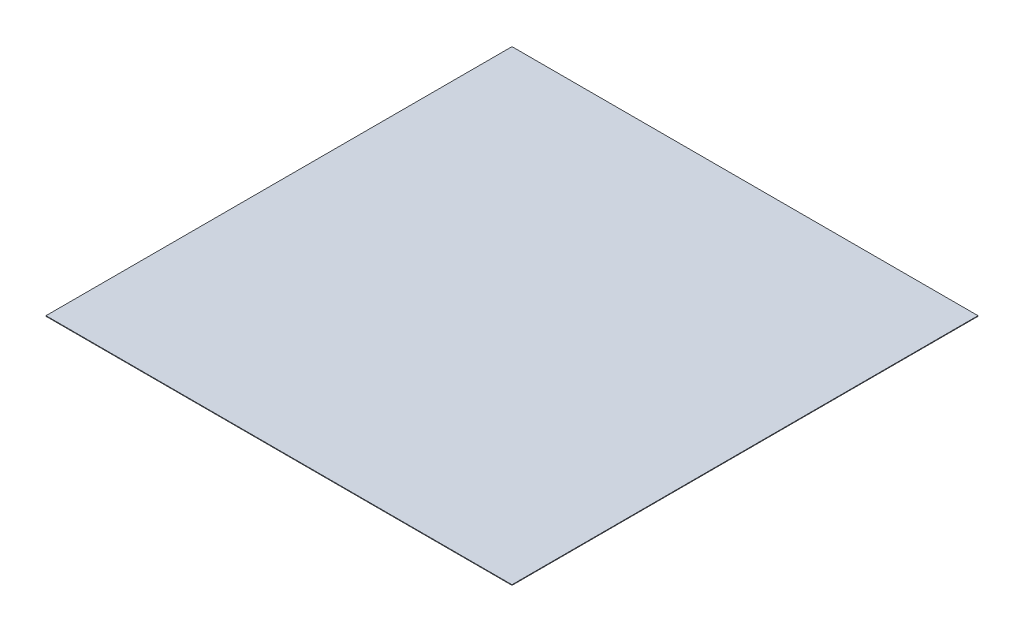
ISO-10303-21;
HEADER;
FILE_DESCRIPTION(('STEP AP214'),'2;1');
FILE_NAME('part.step','',(''),(''),'','','');
FILE_SCHEMA(('AUTOMOTIVE_DESIGN { 1 0 10303 214 1 1 1 1 }'));
ENDSEC;
DATA;
#1=APPLICATION_CONTEXT('core data for automotive mechanical design processes');
#2=APPLICATION_PROTOCOL_DEFINITION('international standard','automotive_design',2000,#1);
#3=PRODUCT_CONTEXT('',#1,'mechanical');
#4=PRODUCT('Part','Part','',(#3));
#5=PRODUCT_RELATED_PRODUCT_CATEGORY('part','',(#4));
#6=PRODUCT_DEFINITION_FORMATION('','',#4);
#7=PRODUCT_DEFINITION_CONTEXT('part definition',#1,'design');
#8=PRODUCT_DEFINITION('design','',#6,#7);
#9=PRODUCT_DEFINITION_SHAPE('','',#8);
#10=(LENGTH_UNIT() NAMED_UNIT(*) SI_UNIT(.MILLI.,.METRE.));
#11=(NAMED_UNIT(*) PLANE_ANGLE_UNIT() SI_UNIT($,.RADIAN.));
#12=(NAMED_UNIT(*) SI_UNIT($,.STERADIAN.) SOLID_ANGLE_UNIT());
#13=UNCERTAINTY_MEASURE_WITH_UNIT(LENGTH_MEASURE(1.E-05),#10,'distance_accuracy_value','');
#14=(GEOMETRIC_REPRESENTATION_CONTEXT(3) GLOBAL_UNCERTAINTY_ASSIGNED_CONTEXT((#13)) GLOBAL_UNIT_ASSIGNED_CONTEXT((#10,
#11,#12)) REPRESENTATION_CONTEXT('',''));
#15=CARTESIAN_POINT('',(0.,0.,0.));
#16=DIRECTION('',(0.,0.,1.));
#17=DIRECTION('',(1.,0.,0.));
#18=AXIS2_PLACEMENT_3D('',#15,#16,#17);
#19=CARTESIAN_POINT('',(10160.,12.7,-10160.));
#20=DIRECTION('',(0.,0.,1.));
#21=DIRECTION('',(1.,0.,0.));
#22=AXIS2_PLACEMENT_3D('',#19,#20,#21);
#23=PLANE('',#22);
#24=DIRECTION('',(0.,1.,0.));
#25=VECTOR('',#24,1.);
#26=CARTESIAN_POINT('',(-10160.,12.7,-10160.));
#27=LINE('',#26,#25);
#28=CARTESIAN_POINT('',(-10160.,-12.7,-10160.));
#29=VERTEX_POINT('',#28);
#30=CARTESIAN_POINT('',(-10160.,12.7,-10160.));
#31=VERTEX_POINT('',#30);
#32=EDGE_CURVE('E96',#29,#31,#27,.T.);
#33=ORIENTED_EDGE('',*,*,#32,.T.);
#34=DIRECTION('',(-1.,0.,0.));
#35=VECTOR('',#34,1.);
#36=CARTESIAN_POINT('',(10160.,12.7,-10160.));
#37=LINE('',#36,#35);
#38=CARTESIAN_POINT('',(10160.,12.7,-10160.));
#39=VERTEX_POINT('',#38);
#40=EDGE_CURVE('E11',#39,#31,#37,.T.);
#41=ORIENTED_EDGE('',*,*,#40,.F.);
#42=DIRECTION('',(0.,1.,0.));
#43=VECTOR('',#42,1.);
#44=CARTESIAN_POINT('',(10160.,12.7,-10160.));
#45=LINE('',#44,#43);
#46=CARTESIAN_POINT('',(10160.,-12.7,-10160.));
#47=VERTEX_POINT('',#46);
#48=EDGE_CURVE('E84',#47,#39,#45,.T.);
#49=ORIENTED_EDGE('',*,*,#48,.F.);
#50=DIRECTION('',(-1.,0.,0.));
#51=VECTOR('',#50,1.);
#52=CARTESIAN_POINT('',(10160.,-12.7,-10160.));
#53=LINE('',#52,#51);
#54=EDGE_CURVE('E92',#47,#29,#53,.T.);
#55=ORIENTED_EDGE('',*,*,#54,.T.);
#56=EDGE_LOOP('',(#33,#41,#49,#55));
#57=FACE_BOUND('',#56,.T.);
#58=ADVANCED_FACE('F33',(#57),#23,.F.);
#59=CARTESIAN_POINT('',(10160.,12.7,10160.));
#60=DIRECTION('',(0.,-1.,0.));
#61=DIRECTION('',(0.,0.,-1.));
#62=AXIS2_PLACEMENT_3D('',#59,#60,#61);
#63=PLANE('',#62);
#64=DIRECTION('',(0.,0.,1.));
#65=VECTOR('',#64,1.);
#66=CARTESIAN_POINT('',(-10160.,12.7,10160.));
#67=LINE('',#66,#65);
#68=CARTESIAN_POINT('',(-10160.,12.7,10160.));
#69=VERTEX_POINT('',#68);
#70=EDGE_CURVE('E88',#31,#69,#67,.T.);
#71=ORIENTED_EDGE('',*,*,#70,.T.);
#72=DIRECTION('',(-1.,0.,0.));
#73=VECTOR('',#72,1.);
#74=CARTESIAN_POINT('',(10160.,12.7,10160.));
#75=LINE('',#74,#73);
#76=CARTESIAN_POINT('',(10160.,12.7,10160.));
#77=VERTEX_POINT('',#76);
#78=EDGE_CURVE('E41',#77,#69,#75,.T.);
#79=ORIENTED_EDGE('',*,*,#78,.F.);
#80=DIRECTION('',(0.,0.,1.));
#81=VECTOR('',#80,1.);
#82=CARTESIAN_POINT('',(10160.,12.7,10160.));
#83=LINE('',#82,#81);
#84=EDGE_CURVE('E79',#39,#77,#83,.T.);
#85=ORIENTED_EDGE('',*,*,#84,.F.);
#86=ORIENTED_EDGE('',*,*,#40,.T.);
#87=EDGE_LOOP('',(#71,#79,#85,#86));
#88=FACE_BOUND('',#87,.T.);
#89=ADVANCED_FACE('F87',(#88),#63,.F.);
#90=CARTESIAN_POINT('',(10160.,12.7,10160.));
#91=DIRECTION('',(0.,0.,-1.));
#92=DIRECTION('',(-1.,0.,0.));
#93=AXIS2_PLACEMENT_3D('',#90,#91,#92);
#94=PLANE('',#93);
#95=DIRECTION('',(0.,-1.,0.));
#96=VECTOR('',#95,1.);
#97=CARTESIAN_POINT('',(-10160.,12.7,10160.));
#98=LINE('',#97,#96);
#99=CARTESIAN_POINT('',(-10160.,-12.7,10160.));
#100=VERTEX_POINT('',#99);
#101=EDGE_CURVE('E66',#69,#100,#98,.T.);
#102=ORIENTED_EDGE('',*,*,#101,.T.);
#103=DIRECTION('',(-1.,0.,0.));
#104=VECTOR('',#103,1.);
#105=CARTESIAN_POINT('',(10160.,-12.7,10160.));
#106=LINE('',#105,#104);
#107=CARTESIAN_POINT('',(10160.,-12.7,10160.));
#108=VERTEX_POINT('',#107);
#109=EDGE_CURVE('E89',#108,#100,#106,.T.);
#110=ORIENTED_EDGE('',*,*,#109,.F.);
#111=DIRECTION('',(0.,-1.,0.));
#112=VECTOR('',#111,1.);
#113=CARTESIAN_POINT('',(10160.,12.7,10160.));
#114=LINE('',#113,#112);
#115=EDGE_CURVE('E82',#77,#108,#114,.T.);
#116=ORIENTED_EDGE('',*,*,#115,.F.);
#117=ORIENTED_EDGE('',*,*,#78,.T.);
#118=EDGE_LOOP('',(#102,#110,#116,#117));
#119=FACE_BOUND('',#118,.T.);
#120=ADVANCED_FACE('F90',(#119),#94,.F.);
#121=CARTESIAN_POINT('',(10160.,-12.7,10160.));
#122=DIRECTION('',(0.,1.,0.));
#123=DIRECTION('',(0.,0.,1.));
#124=AXIS2_PLACEMENT_3D('',#121,#122,#123);
#125=PLANE('',#124);
#126=DIRECTION('',(0.,0.,-1.));
#127=VECTOR('',#126,1.);
#128=CARTESIAN_POINT('',(-10160.,-12.7,10160.));
#129=LINE('',#128,#127);
#130=EDGE_CURVE('E72',#100,#29,#129,.T.);
#131=ORIENTED_EDGE('',*,*,#130,.T.);
#132=ORIENTED_EDGE('',*,*,#54,.F.);
#133=DIRECTION('',(0.,0.,-1.));
#134=VECTOR('',#133,1.);
#135=CARTESIAN_POINT('',(10160.,-12.7,10160.));
#136=LINE('',#135,#134);
#137=EDGE_CURVE('E49',#108,#47,#136,.T.);
#138=ORIENTED_EDGE('',*,*,#137,.F.);
#139=ORIENTED_EDGE('',*,*,#109,.T.);
#140=EDGE_LOOP('',(#131,#132,#138,#139));
#141=FACE_BOUND('',#140,.T.);
#142=ADVANCED_FACE('F103',(#141),#125,.F.);
#143=CARTESIAN_POINT('',(10160.,0.,0.));
#144=DIRECTION('',(1.,0.,0.));
#145=DIRECTION('',(0.,0.,-1.));
#146=AXIS2_PLACEMENT_3D('',#143,#144,#145);
#147=PLANE('',#146);
#148=ORIENTED_EDGE('',*,*,#48,.T.);
#149=ORIENTED_EDGE('',*,*,#84,.T.);
#150=ORIENTED_EDGE('',*,*,#115,.T.);
#151=ORIENTED_EDGE('',*,*,#137,.T.);
#152=EDGE_LOOP('',(#148,#149,#150,#151));
#153=FACE_BOUND('',#152,.T.);
#154=ADVANCED_FACE('F80',(#153),#147,.T.);
#155=CARTESIAN_POINT('',(-10160.,0.,0.));
#156=DIRECTION('',(1.,0.,0.));
#157=DIRECTION('',(0.,0.,-1.));
#158=AXIS2_PLACEMENT_3D('',#155,#156,#157);
#159=PLANE('',#158);
#160=ORIENTED_EDGE('',*,*,#32,.F.);
#161=ORIENTED_EDGE('',*,*,#130,.F.);
#162=ORIENTED_EDGE('',*,*,#101,.F.);
#163=ORIENTED_EDGE('',*,*,#70,.F.);
#164=EDGE_LOOP('',(#160,#161,#162,#163));
#165=FACE_BOUND('',#164,.T.);
#166=ADVANCED_FACE('F106',(#165),#159,.F.);
#167=CLOSED_SHELL('',(#58,#89,#120,#142,#154,#166));
#168=MANIFOLD_SOLID_BREP('B2',#167);
#169=ADVANCED_BREP_SHAPE_REPRESENTATION('',(#18,#168),#14);
#170=SHAPE_DEFINITION_REPRESENTATION(#9,#169);
ENDSEC;
END-ISO-10303-21;
